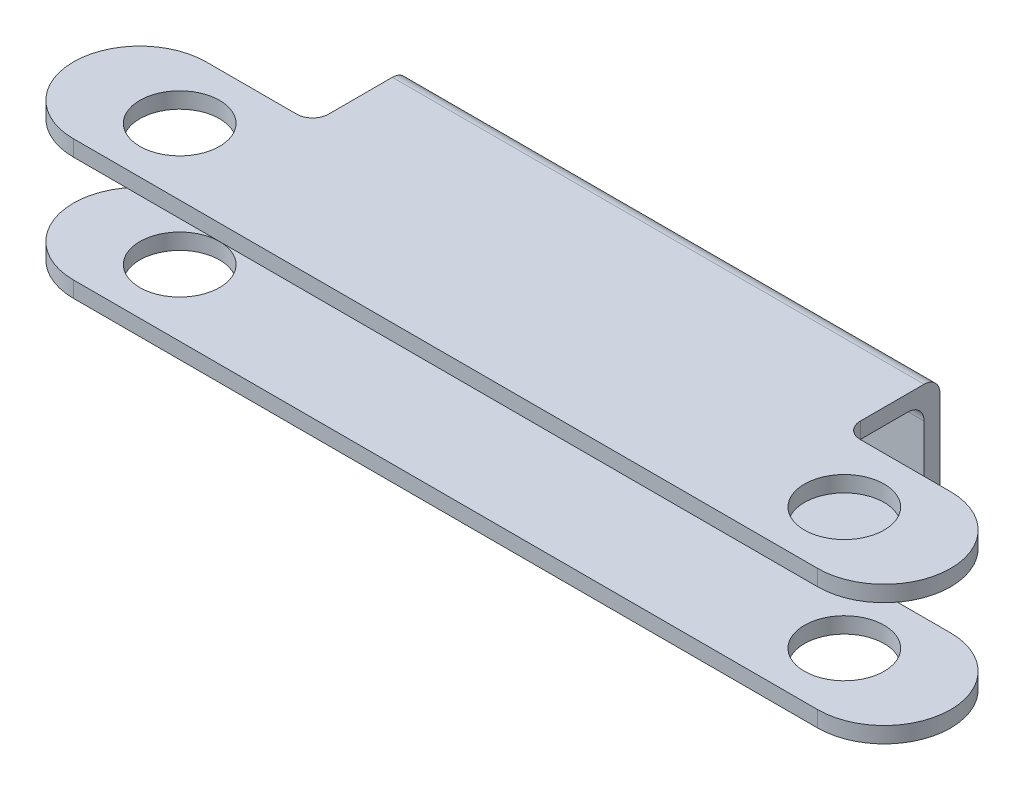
ISO-10303-21;
HEADER;
FILE_DESCRIPTION(('STEP AP214'),'2;1');
FILE_NAME('part.step','',(''),(''),'','','');
FILE_SCHEMA(('AUTOMOTIVE_DESIGN { 1 0 10303 214 1 1 1 1 }'));
ENDSEC;
DATA;
#1=APPLICATION_CONTEXT('core data for automotive mechanical design processes');
#2=APPLICATION_PROTOCOL_DEFINITION('international standard','automotive_design',2000,#1);
#3=PRODUCT_CONTEXT('',#1,'mechanical');
#4=PRODUCT('Part','Part','',(#3));
#5=PRODUCT_RELATED_PRODUCT_CATEGORY('part','',(#4));
#6=PRODUCT_DEFINITION_FORMATION('','',#4);
#7=PRODUCT_DEFINITION_CONTEXT('part definition',#1,'design');
#8=PRODUCT_DEFINITION('design','',#6,#7);
#9=PRODUCT_DEFINITION_SHAPE('','',#8);
#10=(LENGTH_UNIT() NAMED_UNIT(*) SI_UNIT(.MILLI.,.METRE.));
#11=(NAMED_UNIT(*) PLANE_ANGLE_UNIT() SI_UNIT($,.RADIAN.));
#12=(NAMED_UNIT(*) SI_UNIT($,.STERADIAN.) SOLID_ANGLE_UNIT());
#13=UNCERTAINTY_MEASURE_WITH_UNIT(LENGTH_MEASURE(1.E-05),#10,'distance_accuracy_value','');
#14=(GEOMETRIC_REPRESENTATION_CONTEXT(3) GLOBAL_UNCERTAINTY_ASSIGNED_CONTEXT((#13)) GLOBAL_UNIT_ASSIGNED_CONTEXT((#10,
#11,#12)) REPRESENTATION_CONTEXT('',''));
#15=CARTESIAN_POINT('',(0.,0.,0.));
#16=DIRECTION('',(0.,0.,1.));
#17=DIRECTION('',(1.,0.,0.));
#18=AXIS2_PLACEMENT_3D('',#15,#16,#17);
#19=CARTESIAN_POINT('',(-100.,-49.,-55.));
#20=DIRECTION('',(0.,0.,1.));
#21=DIRECTION('',(1.,0.,0.));
#22=AXIS2_PLACEMENT_3D('',#19,#20,#21);
#23=PLANE('',#22);
#24=DIRECTION('',(0.,1.,0.));
#25=VECTOR('',#24,1.);
#26=CARTESIAN_POINT('',(-100.,-49.,-55.));
#27=LINE('',#26,#25);
#28=CARTESIAN_POINT('',(-100.,-40.,-55.));
#29=VERTEX_POINT('',#28);
#30=CARTESIAN_POINT('',(-100.,-6.,-55.));
#31=VERTEX_POINT('',#30);
#32=EDGE_CURVE('E34',#29,#31,#27,.T.);
#33=ORIENTED_EDGE('',*,*,#32,.F.);
#34=DIRECTION('',(-1.,0.,0.));
#35=VECTOR('',#34,1.);
#36=CARTESIAN_POINT('',(-100.,-40.,-55.));
#37=LINE('',#36,#35);
#38=CARTESIAN_POINT('',(100.,-40.,-55.));
#39=VERTEX_POINT('',#38);
#40=EDGE_CURVE('E254',#39,#29,#37,.T.);
#41=ORIENTED_EDGE('',*,*,#40,.F.);
#42=DIRECTION('',(0.,1.,0.));
#43=VECTOR('',#42,1.);
#44=CARTESIAN_POINT('',(100.,-49.,-55.));
#45=LINE('',#44,#43);
#46=CARTESIAN_POINT('',(100.,-6.,-55.));
#47=VERTEX_POINT('',#46);
#48=EDGE_CURVE('E309',#39,#47,#45,.T.);
#49=ORIENTED_EDGE('',*,*,#48,.T.);
#50=DIRECTION('',(-1.,0.,0.));
#51=VECTOR('',#50,1.);
#52=CARTESIAN_POINT('',(-100.,-6.,-55.));
#53=LINE('',#52,#51);
#54=EDGE_CURVE('E313',#47,#31,#53,.T.);
#55=ORIENTED_EDGE('',*,*,#54,.T.);
#56=EDGE_LOOP('',(#33,#41,#49,#55));
#57=FACE_BOUND('',#56,.T.);
#58=ADVANCED_FACE('F30',(#57),#23,.T.);
#59=CARTESIAN_POINT('',(-106.,6.,-31.));
#60=DIRECTION('',(0.,1.,0.));
#61=DIRECTION('',(0.,0.,1.));
#62=AXIS2_PLACEMENT_3D('',#59,#60,#61);
#63=PLANE('',#62);
#64=CARTESIAN_POINT('',(-125.,6.,0.));
#65=DIRECTION('',(0.,1.,0.));
#66=DIRECTION('',(0.,0.,1.));
#67=AXIS2_PLACEMENT_3D('',#64,#65,#66);
#68=CIRCLE('',#67,15.);
#69=CARTESIAN_POINT('',(-125.,6.,15.));
#70=VERTEX_POINT('',#69);
#71=EDGE_CURVE('E360',#70,#70,#68,.T.);
#72=ORIENTED_EDGE('',*,*,#71,.F.);
#73=EDGE_LOOP('',(#72));
#74=FACE_BOUND('',#73,.T.);
#75=DIRECTION('',(0.,0.,-1.));
#76=VECTOR('',#75,1.);
#77=CARTESIAN_POINT('',(100.,6.,-55.));
#78=LINE('',#77,#76);
#79=CARTESIAN_POINT('',(100.,6.,-31.));
#80=VERTEX_POINT('',#79);
#81=CARTESIAN_POINT('',(100.,6.,-55.));
#82=VERTEX_POINT('',#81);
#83=EDGE_CURVE('E420',#80,#82,#78,.T.);
#84=ORIENTED_EDGE('',*,*,#83,.T.);
#85=DIRECTION('',(-1.,0.,0.));
#86=VECTOR('',#85,1.);
#87=CARTESIAN_POINT('',(-106.,6.,-55.));
#88=LINE('',#87,#86);
#89=CARTESIAN_POINT('',(-100.,6.,-55.));
#90=VERTEX_POINT('',#89);
#91=EDGE_CURVE('E329',#82,#90,#88,.T.);
#92=ORIENTED_EDGE('',*,*,#91,.T.);
#93=DIRECTION('',(0.,0.,1.));
#94=VECTOR('',#93,1.);
#95=CARTESIAN_POINT('',(-100.,6.,-31.));
#96=LINE('',#95,#94);
#97=CARTESIAN_POINT('',(-100.,6.,-31.));
#98=VERTEX_POINT('',#97);
#99=EDGE_CURVE('E368',#90,#98,#96,.T.);
#100=ORIENTED_EDGE('',*,*,#99,.T.);
#101=CARTESIAN_POINT('',(-106.,6.,-31.));
#102=DIRECTION('',(0.,-1.,0.));
#103=DIRECTION('',(0.,0.,1.));
#104=AXIS2_PLACEMENT_3D('',#101,#102,#103);
#105=CIRCLE('',#104,5.99999999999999);
#106=CARTESIAN_POINT('',(-106.,6.,-25.));
#107=VERTEX_POINT('',#106);
#108=EDGE_CURVE('E317',#98,#107,#105,.T.);
#109=ORIENTED_EDGE('',*,*,#108,.T.);
#110=DIRECTION('',(-1.,0.,0.));
#111=VECTOR('',#110,1.);
#112=CARTESIAN_POINT('',(-140.,6.,-25.));
#113=LINE('',#112,#111);
#114=CARTESIAN_POINT('',(-140.,6.,-25.));
#115=VERTEX_POINT('',#114);
#116=EDGE_CURVE('E402',#107,#115,#113,.T.);
#117=ORIENTED_EDGE('',*,*,#116,.T.);
#118=CARTESIAN_POINT('',(-140.,6.,0.));
#119=DIRECTION('',(0.,1.,0.));
#120=DIRECTION('',(0.,0.,1.));
#121=AXIS2_PLACEMENT_3D('',#118,#119,#120);
#122=CIRCLE('',#121,25.);
#123=CARTESIAN_POINT('',(-140.,6.,25.));
#124=VERTEX_POINT('',#123);
#125=EDGE_CURVE('E408',#115,#124,#122,.T.);
#126=ORIENTED_EDGE('',*,*,#125,.T.);
#127=DIRECTION('',(1.,0.,0.));
#128=VECTOR('',#127,1.);
#129=CARTESIAN_POINT('',(-140.,6.,25.));
#130=LINE('',#129,#128);
#131=CARTESIAN_POINT('',(140.,6.,25.));
#132=VERTEX_POINT('',#131);
#133=EDGE_CURVE('E413',#124,#132,#130,.T.);
#134=ORIENTED_EDGE('',*,*,#133,.T.);
#135=CARTESIAN_POINT('',(140.,6.,0.));
#136=DIRECTION('',(0.,1.,0.));
#137=DIRECTION('',(0.,0.,1.));
#138=AXIS2_PLACEMENT_3D('',#135,#136,#137);
#139=CIRCLE('',#138,25.);
#140=CARTESIAN_POINT('',(140.,6.,-24.9999999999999));
#141=VERTEX_POINT('',#140);
#142=EDGE_CURVE('E415',#132,#141,#139,.T.);
#143=ORIENTED_EDGE('',*,*,#142,.T.);
#144=DIRECTION('',(-1.,0.,0.));
#145=VECTOR('',#144,1.);
#146=CARTESIAN_POINT('',(106.,6.,-25.));
#147=LINE('',#146,#145);
#148=CARTESIAN_POINT('',(106.,6.,-25.));
#149=VERTEX_POINT('',#148);
#150=EDGE_CURVE('E417',#141,#149,#147,.T.);
#151=ORIENTED_EDGE('',*,*,#150,.T.);
#152=CARTESIAN_POINT('',(106.,6.,-31.));
#153=DIRECTION('',(0.,-1.,0.));
#154=DIRECTION('',(0.,0.,1.));
#155=AXIS2_PLACEMENT_3D('',#152,#153,#154);
#156=CIRCLE('',#155,6.00000000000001);
#157=EDGE_CURVE('E419',#149,#80,#156,.T.);
#158=ORIENTED_EDGE('',*,*,#157,.T.);
#159=EDGE_LOOP('',(#84,#92,#100,#109,#117,#126,#134,#143,#151,#158));
#160=FACE_BOUND('',#159,.T.);
#161=CARTESIAN_POINT('',(125.,6.,0.));
#162=DIRECTION('',(0.,1.,0.));
#163=DIRECTION('',(0.,0.,1.));
#164=AXIS2_PLACEMENT_3D('',#161,#162,#163);
#165=CIRCLE('',#164,15.);
#166=CARTESIAN_POINT('',(125.,6.,15.));
#167=VERTEX_POINT('',#166);
#168=EDGE_CURVE('E771',#167,#167,#165,.T.);
#169=ORIENTED_EDGE('',*,*,#168,.F.);
#170=EDGE_LOOP('',(#169));
#171=FACE_BOUND('',#170,.T.);
#172=ADVANCED_FACE('F422',(#74,#160,#171),#63,.T.);
#173=CARTESIAN_POINT('',(-106.,0.,-31.));
#174=DIRECTION('',(0.,1.,0.));
#175=DIRECTION('',(0.,0.,1.));
#176=AXIS2_PLACEMENT_3D('',#173,#174,#175);
#177=PLANE('',#176);
#178=CARTESIAN_POINT('',(-125.,0.,0.));
#179=DIRECTION('',(0.,1.,0.));
#180=DIRECTION('',(0.,0.,1.));
#181=AXIS2_PLACEMENT_3D('',#178,#179,#180);
#182=CIRCLE('',#181,15.);
#183=CARTESIAN_POINT('',(-125.,0.,15.));
#184=VERTEX_POINT('',#183);
#185=EDGE_CURVE('E365',#184,#184,#182,.T.);
#186=ORIENTED_EDGE('',*,*,#185,.T.);
#187=EDGE_LOOP('',(#186));
#188=FACE_BOUND('',#187,.T.);
#189=DIRECTION('',(0.,0.,1.));
#190=VECTOR('',#189,1.);
#191=CARTESIAN_POINT('',(-100.,0.,-31.));
#192=LINE('',#191,#190);
#193=CARTESIAN_POINT('',(-100.,0.,-49.));
#194=VERTEX_POINT('',#193);
#195=CARTESIAN_POINT('',(-100.,0.,-31.));
#196=VERTEX_POINT('',#195);
#197=EDGE_CURVE('E314',#194,#196,#192,.T.);
#198=ORIENTED_EDGE('',*,*,#197,.F.);
#199=DIRECTION('',(-1.,0.,0.));
#200=VECTOR('',#199,1.);
#201=CARTESIAN_POINT('',(-106.,0.,-49.));
#202=LINE('',#201,#200);
#203=CARTESIAN_POINT('',(100.,0.,-49.));
#204=VERTEX_POINT('',#203);
#205=EDGE_CURVE('E56',#194,#204,#202,.F.);
#206=ORIENTED_EDGE('',*,*,#205,.T.);
#207=DIRECTION('',(0.,0.,-1.));
#208=VECTOR('',#207,1.);
#209=CARTESIAN_POINT('',(100.,0.,-55.));
#210=LINE('',#209,#208);
#211=CARTESIAN_POINT('',(100.,0.,-31.));
#212=VERTEX_POINT('',#211);
#213=EDGE_CURVE('E318',#212,#204,#210,.T.);
#214=ORIENTED_EDGE('',*,*,#213,.F.);
#215=CARTESIAN_POINT('',(106.,0.,-31.));
#216=DIRECTION('',(0.,-1.,0.));
#217=DIRECTION('',(0.,0.,1.));
#218=AXIS2_PLACEMENT_3D('',#215,#216,#217);
#219=CIRCLE('',#218,6.00000000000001);
#220=CARTESIAN_POINT('',(106.,0.,-25.));
#221=VERTEX_POINT('',#220);
#222=EDGE_CURVE('E326',#221,#212,#219,.T.);
#223=ORIENTED_EDGE('',*,*,#222,.F.);
#224=DIRECTION('',(-1.,0.,0.));
#225=VECTOR('',#224,1.);
#226=CARTESIAN_POINT('',(106.,0.,-25.));
#227=LINE('',#226,#225);
#228=CARTESIAN_POINT('',(140.,0.,-24.9999999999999));
#229=VERTEX_POINT('',#228);
#230=EDGE_CURVE('E376',#229,#221,#227,.T.);
#231=ORIENTED_EDGE('',*,*,#230,.F.);
#232=CARTESIAN_POINT('',(140.,0.,0.));
#233=DIRECTION('',(0.,1.,0.));
#234=DIRECTION('',(0.,0.,1.));
#235=AXIS2_PLACEMENT_3D('',#232,#233,#234);
#236=CIRCLE('',#235,25.);
#237=CARTESIAN_POINT('',(140.,0.,25.));
#238=VERTEX_POINT('',#237);
#239=EDGE_CURVE('E374',#238,#229,#236,.T.);
#240=ORIENTED_EDGE('',*,*,#239,.F.);
#241=DIRECTION('',(1.,0.,0.));
#242=VECTOR('',#241,1.);
#243=CARTESIAN_POINT('',(-140.,0.,25.));
#244=LINE('',#243,#242);
#245=CARTESIAN_POINT('',(-140.,0.,25.));
#246=VERTEX_POINT('',#245);
#247=EDGE_CURVE('E372',#246,#238,#244,.T.);
#248=ORIENTED_EDGE('',*,*,#247,.F.);
#249=CARTESIAN_POINT('',(-140.,0.,0.));
#250=DIRECTION('',(0.,1.,0.));
#251=DIRECTION('',(0.,0.,1.));
#252=AXIS2_PLACEMENT_3D('',#249,#250,#251);
#253=CIRCLE('',#252,25.);
#254=CARTESIAN_POINT('',(-140.,0.,-25.));
#255=VERTEX_POINT('',#254);
#256=EDGE_CURVE('E362',#255,#246,#253,.T.);
#257=ORIENTED_EDGE('',*,*,#256,.F.);
#258=DIRECTION('',(-1.,0.,0.));
#259=VECTOR('',#258,1.);
#260=CARTESIAN_POINT('',(-140.,0.,-25.));
#261=LINE('',#260,#259);
#262=CARTESIAN_POINT('',(-106.,0.,-25.));
#263=VERTEX_POINT('',#262);
#264=EDGE_CURVE('E356',#263,#255,#261,.T.);
#265=ORIENTED_EDGE('',*,*,#264,.F.);
#266=CARTESIAN_POINT('',(-106.,0.,-31.));
#267=DIRECTION('',(0.,-1.,0.));
#268=DIRECTION('',(0.,0.,1.));
#269=AXIS2_PLACEMENT_3D('',#266,#267,#268);
#270=CIRCLE('',#269,5.99999999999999);
#271=EDGE_CURVE('E354',#196,#263,#270,.T.);
#272=ORIENTED_EDGE('',*,*,#271,.F.);
#273=EDGE_LOOP('',(#198,#206,#214,#223,#231,#240,#248,#257,#265,#272));
#274=FACE_BOUND('',#273,.T.);
#275=CARTESIAN_POINT('',(125.,0.,0.));
#276=DIRECTION('',(0.,1.,0.));
#277=DIRECTION('',(0.,0.,1.));
#278=AXIS2_PLACEMENT_3D('',#275,#276,#277);
#279=CIRCLE('',#278,15.);
#280=CARTESIAN_POINT('',(125.,0.,15.));
#281=VERTEX_POINT('',#280);
#282=EDGE_CURVE('E298',#281,#281,#279,.T.);
#283=ORIENTED_EDGE('',*,*,#282,.T.);
#284=EDGE_LOOP('',(#283));
#285=FACE_BOUND('',#284,.T.);
#286=ADVANCED_FACE('F351',(#188,#274,#285),#177,.F.);
#287=CARTESIAN_POINT('',(-106.,6.,-31.));
#288=DIRECTION('',(0.,-1.,0.));
#289=DIRECTION('',(0.,0.,-1.));
#290=AXIS2_PLACEMENT_3D('',#287,#288,#289);
#291=CYLINDRICAL_SURFACE('',#290,5.99999999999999);
#292=ORIENTED_EDGE('',*,*,#271,.T.);
#293=DIRECTION('',(0.,-1.,0.));
#294=VECTOR('',#293,1.);
#295=CARTESIAN_POINT('',(-106.,6.,-25.));
#296=LINE('',#295,#294);
#297=EDGE_CURVE('E323',#107,#263,#296,.T.);
#298=ORIENTED_EDGE('',*,*,#297,.F.);
#299=ORIENTED_EDGE('',*,*,#108,.F.);
#300=DIRECTION('',(0.,-1.,0.));
#301=VECTOR('',#300,1.);
#302=CARTESIAN_POINT('',(-100.,6.,-31.));
#303=LINE('',#302,#301);
#304=EDGE_CURVE('E379',#98,#196,#303,.T.);
#305=ORIENTED_EDGE('',*,*,#304,.T.);
#306=EDGE_LOOP('',(#292,#298,#299,#305));
#307=FACE_BOUND('',#306,.T.);
#308=ADVANCED_FACE('F405',(#307),#291,.F.);
#309=CARTESIAN_POINT('',(-140.,6.,-25.));
#310=DIRECTION('',(0.,0.,1.));
#311=DIRECTION('',(1.,0.,0.));
#312=AXIS2_PLACEMENT_3D('',#309,#310,#311);
#313=PLANE('',#312);
#314=ORIENTED_EDGE('',*,*,#264,.T.);
#315=DIRECTION('',(0.,-1.,0.));
#316=VECTOR('',#315,1.);
#317=CARTESIAN_POINT('',(-140.,6.,-25.));
#318=LINE('',#317,#316);
#319=EDGE_CURVE('E395',#115,#255,#318,.T.);
#320=ORIENTED_EDGE('',*,*,#319,.F.);
#321=ORIENTED_EDGE('',*,*,#116,.F.);
#322=ORIENTED_EDGE('',*,*,#297,.T.);
#323=EDGE_LOOP('',(#314,#320,#321,#322));
#324=FACE_BOUND('',#323,.T.);
#325=ADVANCED_FACE('F401',(#324),#313,.F.);
#326=CARTESIAN_POINT('',(-140.,6.,0.));
#327=DIRECTION('',(0.,-1.,0.));
#328=DIRECTION('',(0.,0.,-1.));
#329=AXIS2_PLACEMENT_3D('',#326,#327,#328);
#330=CYLINDRICAL_SURFACE('',#329,25.);
#331=ORIENTED_EDGE('',*,*,#256,.T.);
#332=DIRECTION('',(0.,-1.,0.));
#333=VECTOR('',#332,1.);
#334=CARTESIAN_POINT('',(-140.,6.,25.));
#335=LINE('',#334,#333);
#336=EDGE_CURVE('E393',#124,#246,#335,.T.);
#337=ORIENTED_EDGE('',*,*,#336,.F.);
#338=ORIENTED_EDGE('',*,*,#125,.F.);
#339=ORIENTED_EDGE('',*,*,#319,.T.);
#340=EDGE_LOOP('',(#331,#337,#338,#339));
#341=FACE_BOUND('',#340,.T.);
#342=ADVANCED_FACE('F505',(#341),#330,.T.);
#343=CARTESIAN_POINT('',(-140.,6.,25.));
#344=DIRECTION('',(0.,0.,-1.));
#345=DIRECTION('',(-1.,0.,0.));
#346=AXIS2_PLACEMENT_3D('',#343,#344,#345);
#347=PLANE('',#346);
#348=ORIENTED_EDGE('',*,*,#247,.T.);
#349=DIRECTION('',(0.,-1.,0.));
#350=VECTOR('',#349,1.);
#351=CARTESIAN_POINT('',(140.,6.,25.));
#352=LINE('',#351,#350);
#353=EDGE_CURVE('E390',#132,#238,#352,.T.);
#354=ORIENTED_EDGE('',*,*,#353,.F.);
#355=ORIENTED_EDGE('',*,*,#133,.F.);
#356=ORIENTED_EDGE('',*,*,#336,.T.);
#357=EDGE_LOOP('',(#348,#354,#355,#356));
#358=FACE_BOUND('',#357,.T.);
#359=ADVANCED_FACE('F502',(#358),#347,.F.);
#360=CARTESIAN_POINT('',(140.,6.,0.));
#361=DIRECTION('',(0.,-1.,0.));
#362=DIRECTION('',(0.,0.,-1.));
#363=AXIS2_PLACEMENT_3D('',#360,#361,#362);
#364=CYLINDRICAL_SURFACE('',#363,25.);
#365=ORIENTED_EDGE('',*,*,#239,.T.);
#366=DIRECTION('',(0.,-1.,0.));
#367=VECTOR('',#366,1.);
#368=CARTESIAN_POINT('',(140.,6.,-24.9999999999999));
#369=LINE('',#368,#367);
#370=EDGE_CURVE('E387',#141,#229,#369,.T.);
#371=ORIENTED_EDGE('',*,*,#370,.F.);
#372=ORIENTED_EDGE('',*,*,#142,.F.);
#373=ORIENTED_EDGE('',*,*,#353,.T.);
#374=EDGE_LOOP('',(#365,#371,#372,#373));
#375=FACE_BOUND('',#374,.T.);
#376=ADVANCED_FACE('F498',(#375),#364,.T.);
#377=CARTESIAN_POINT('',(106.,6.,-25.));
#378=DIRECTION('',(0.,0.,1.));
#379=DIRECTION('',(1.,0.,0.));
#380=AXIS2_PLACEMENT_3D('',#377,#378,#379);
#381=PLANE('',#380);
#382=ORIENTED_EDGE('',*,*,#230,.T.);
#383=DIRECTION('',(0.,-1.,0.));
#384=VECTOR('',#383,1.);
#385=CARTESIAN_POINT('',(106.,6.,-25.));
#386=LINE('',#385,#384);
#387=EDGE_CURVE('E384',#149,#221,#386,.T.);
#388=ORIENTED_EDGE('',*,*,#387,.F.);
#389=ORIENTED_EDGE('',*,*,#150,.F.);
#390=ORIENTED_EDGE('',*,*,#370,.T.);
#391=EDGE_LOOP('',(#382,#388,#389,#390));
#392=FACE_BOUND('',#391,.T.);
#393=ADVANCED_FACE('F494',(#392),#381,.F.);
#394=CARTESIAN_POINT('',(106.,6.,-31.));
#395=DIRECTION('',(0.,-1.,0.));
#396=DIRECTION('',(0.,0.,-1.));
#397=AXIS2_PLACEMENT_3D('',#394,#395,#396);
#398=CYLINDRICAL_SURFACE('',#397,6.00000000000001);
#399=ORIENTED_EDGE('',*,*,#222,.T.);
#400=DIRECTION('',(0.,-1.,0.));
#401=VECTOR('',#400,1.);
#402=CARTESIAN_POINT('',(100.,6.,-31.));
#403=LINE('',#402,#401);
#404=EDGE_CURVE('E381',#80,#212,#403,.T.);
#405=ORIENTED_EDGE('',*,*,#404,.F.);
#406=ORIENTED_EDGE('',*,*,#157,.F.);
#407=ORIENTED_EDGE('',*,*,#387,.T.);
#408=EDGE_LOOP('',(#399,#405,#406,#407));
#409=FACE_BOUND('',#408,.T.);
#410=ADVANCED_FACE('F489',(#409),#398,.F.);
#411=CARTESIAN_POINT('',(100.,6.,-55.));
#412=DIRECTION('',(-1.,0.,0.));
#413=DIRECTION('',(0.,0.,1.));
#414=AXIS2_PLACEMENT_3D('',#411,#412,#413);
#415=PLANE('',#414);
#416=DIRECTION('',(0.,1.,0.));
#417=VECTOR('',#416,1.);
#418=CARTESIAN_POINT('',(100.,-49.,-61.));
#419=LINE('',#418,#417);
#420=CARTESIAN_POINT('',(100.,-49.,-61.));
#421=VERTEX_POINT('',#420);
#422=CARTESIAN_POINT('',(100.,0.,-61.));
#423=VERTEX_POINT('',#422);
#424=EDGE_CURVE('E299',#421,#423,#419,.T.);
#425=ORIENTED_EDGE('',*,*,#424,.T.);
#426=CARTESIAN_POINT('',(100.,0.,-55.));
#427=DIRECTION('',(-1.,0.,0.));
#428=DIRECTION('',(0.,0.,1.));
#429=AXIS2_PLACEMENT_3D('',#426,#427,#428);
#430=CIRCLE('',#429,6.);
#431=EDGE_CURVE('E335',#423,#82,#430,.F.);
#432=ORIENTED_EDGE('',*,*,#431,.T.);
#433=ORIENTED_EDGE('',*,*,#83,.F.);
#434=ORIENTED_EDGE('',*,*,#404,.T.);
#435=ORIENTED_EDGE('',*,*,#213,.T.);
#436=CARTESIAN_POINT('',(100.,-6.,-49.));
#437=DIRECTION('',(-1.,0.,0.));
#438=DIRECTION('',(0.,0.,1.));
#439=AXIS2_PLACEMENT_3D('',#436,#437,#438);
#440=CIRCLE('',#439,6.);
#441=EDGE_CURVE('E11',#204,#47,#440,.T.);
#442=ORIENTED_EDGE('',*,*,#441,.T.);
#443=ORIENTED_EDGE('',*,*,#48,.F.);
#444=DIRECTION('',(0.,0.,-1.));
#445=VECTOR('',#444,1.);
#446=CARTESIAN_POINT('',(100.,-40.,-55.));
#447=LINE('',#446,#445);
#448=CARTESIAN_POINT('',(100.,-40.,-31.));
#449=VERTEX_POINT('',#448);
#450=EDGE_CURVE('E48',#449,#39,#447,.T.);
#451=ORIENTED_EDGE('',*,*,#450,.F.);
#452=DIRECTION('',(0.,1.,0.));
#453=VECTOR('',#452,1.);
#454=CARTESIAN_POINT('',(100.,-46.,-31.));
#455=LINE('',#454,#453);
#456=CARTESIAN_POINT('',(100.,-46.,-31.));
#457=VERTEX_POINT('',#456);
#458=EDGE_CURVE('E209',#457,#449,#455,.T.);
#459=ORIENTED_EDGE('',*,*,#458,.F.);
#460=DIRECTION('',(0.,0.,-1.));
#461=VECTOR('',#460,1.);
#462=CARTESIAN_POINT('',(100.,-46.,-55.));
#463=LINE('',#462,#461);
#464=CARTESIAN_POINT('',(100.,-46.,-55.));
#465=VERTEX_POINT('',#464);
#466=EDGE_CURVE('E227',#457,#465,#463,.T.);
#467=ORIENTED_EDGE('',*,*,#466,.T.);
#468=CARTESIAN_POINT('',(100.,-49.,-55.));
#469=VERTEX_POINT('',#468);
#470=EDGE_CURVE('E302',#469,#465,#45,.T.);
#471=ORIENTED_EDGE('',*,*,#470,.F.);
#472=DIRECTION('',(0.,0.,-1.));
#473=VECTOR('',#472,1.);
#474=CARTESIAN_POINT('',(100.,-49.,-55.));
#475=LINE('',#474,#473);
#476=EDGE_CURVE('E289',#469,#421,#475,.T.);
#477=ORIENTED_EDGE('',*,*,#476,.T.);
#478=EDGE_LOOP('',(#425,#432,#433,#434,#435,#442,#443,#451,#459,#467,#471,#477));
#479=FACE_BOUND('',#478,.T.);
#480=ADVANCED_FACE('F460',(#479),#415,.F.);
#481=CARTESIAN_POINT('',(-100.,6.,-31.));
#482=DIRECTION('',(1.,0.,0.));
#483=DIRECTION('',(0.,0.,-1.));
#484=AXIS2_PLACEMENT_3D('',#481,#482,#483);
#485=PLANE('',#484);
#486=ORIENTED_EDGE('',*,*,#99,.F.);
#487=CARTESIAN_POINT('',(-100.,0.,-55.));
#488=DIRECTION('',(1.,0.,0.));
#489=DIRECTION('',(0.,0.,-1.));
#490=AXIS2_PLACEMENT_3D('',#487,#488,#489);
#491=CIRCLE('',#490,6.);
#492=CARTESIAN_POINT('',(-100.,0.,-61.));
#493=VERTEX_POINT('',#492);
#494=EDGE_CURVE('E332',#90,#493,#491,.F.);
#495=ORIENTED_EDGE('',*,*,#494,.T.);
#496=DIRECTION('',(0.,1.,0.));
#497=VECTOR('',#496,1.);
#498=CARTESIAN_POINT('',(-100.,-49.,-61.));
#499=LINE('',#498,#497);
#500=CARTESIAN_POINT('',(-100.,-49.,-61.));
#501=VERTEX_POINT('',#500);
#502=EDGE_CURVE('E295',#501,#493,#499,.T.);
#503=ORIENTED_EDGE('',*,*,#502,.F.);
#504=DIRECTION('',(0.,0.,1.));
#505=VECTOR('',#504,1.);
#506=CARTESIAN_POINT('',(-100.,-49.,-55.));
#507=LINE('',#506,#505);
#508=CARTESIAN_POINT('',(-100.,-49.,-55.));
#509=VERTEX_POINT('',#508);
#510=EDGE_CURVE('E208',#501,#509,#507,.T.);
#511=ORIENTED_EDGE('',*,*,#510,.T.);
#512=CARTESIAN_POINT('',(-100.,-46.,-55.));
#513=VERTEX_POINT('',#512);
#514=EDGE_CURVE('E224',#509,#513,#27,.T.);
#515=ORIENTED_EDGE('',*,*,#514,.T.);
#516=DIRECTION('',(0.,0.,1.));
#517=VECTOR('',#516,1.);
#518=CARTESIAN_POINT('',(-100.,-46.,-31.));
#519=LINE('',#518,#517);
#520=CARTESIAN_POINT('',(-100.,-46.,-31.));
#521=VERTEX_POINT('',#520);
#522=EDGE_CURVE('E213',#513,#521,#519,.T.);
#523=ORIENTED_EDGE('',*,*,#522,.T.);
#524=DIRECTION('',(0.,1.,0.));
#525=VECTOR('',#524,1.);
#526=CARTESIAN_POINT('',(-100.,-46.,-31.));
#527=LINE('',#526,#525);
#528=CARTESIAN_POINT('',(-100.,-40.,-31.));
#529=VERTEX_POINT('',#528);
#530=EDGE_CURVE('E198',#521,#529,#527,.T.);
#531=ORIENTED_EDGE('',*,*,#530,.T.);
#532=DIRECTION('',(0.,0.,1.));
#533=VECTOR('',#532,1.);
#534=CARTESIAN_POINT('',(-100.,-40.,-31.));
#535=LINE('',#534,#533);
#536=EDGE_CURVE('E251',#29,#529,#535,.T.);
#537=ORIENTED_EDGE('',*,*,#536,.F.);
#538=ORIENTED_EDGE('',*,*,#32,.T.);
#539=CARTESIAN_POINT('',(-100.,-6.,-49.));
#540=DIRECTION('',(1.,0.,0.));
#541=DIRECTION('',(0.,0.,-1.));
#542=AXIS2_PLACEMENT_3D('',#539,#540,#541);
#543=CIRCLE('',#542,6.);
#544=EDGE_CURVE('E40',#31,#194,#543,.T.);
#545=ORIENTED_EDGE('',*,*,#544,.T.);
#546=ORIENTED_EDGE('',*,*,#197,.T.);
#547=ORIENTED_EDGE('',*,*,#304,.F.);
#548=EDGE_LOOP('',(#486,#495,#503,#511,#515,#523,#531,#537,#538,#545,#546,#547));
#549=FACE_BOUND('',#548,.T.);
#550=ADVANCED_FACE('F222',(#549),#485,.F.);
#551=CARTESIAN_POINT('',(-125.,6.,0.));
#552=DIRECTION('',(0.,-1.,0.));
#553=DIRECTION('',(0.,0.,-1.));
#554=AXIS2_PLACEMENT_3D('',#551,#552,#553);
#555=CYLINDRICAL_SURFACE('',#554,15.);
#556=ORIENTED_EDGE('',*,*,#71,.T.);
#557=EDGE_LOOP('',(#556));
#558=FACE_BOUND('',#557,.T.);
#559=ORIENTED_EDGE('',*,*,#185,.F.);
#560=EDGE_LOOP('',(#559));
#561=FACE_BOUND('',#560,.T.);
#562=ADVANCED_FACE('F528',(#558,#561),#555,.F.);
#563=CARTESIAN_POINT('',(125.,6.,0.));
#564=DIRECTION('',(0.,-1.,0.));
#565=DIRECTION('',(0.,0.,-1.));
#566=AXIS2_PLACEMENT_3D('',#563,#564,#565);
#567=CYLINDRICAL_SURFACE('',#566,15.);
#568=ORIENTED_EDGE('',*,*,#168,.T.);
#569=EDGE_LOOP('',(#568));
#570=FACE_BOUND('',#569,.T.);
#571=ORIENTED_EDGE('',*,*,#282,.F.);
#572=EDGE_LOOP('',(#571));
#573=FACE_BOUND('',#572,.T.);
#574=ADVANCED_FACE('F455',(#570,#573),#567,.F.);
#575=CARTESIAN_POINT('',(-100.,-49.,-61.));
#576=DIRECTION('',(0.,0.,-1.));
#577=DIRECTION('',(-1.,0.,0.));
#578=AXIS2_PLACEMENT_3D('',#575,#576,#577);
#579=PLANE('',#578);
#580=ORIENTED_EDGE('',*,*,#502,.T.);
#581=DIRECTION('',(-1.,0.,0.));
#582=VECTOR('',#581,1.);
#583=CARTESIAN_POINT('',(-100.,0.,-61.));
#584=LINE('',#583,#582);
#585=EDGE_CURVE('E334',#493,#423,#584,.F.);
#586=ORIENTED_EDGE('',*,*,#585,.T.);
#587=ORIENTED_EDGE('',*,*,#424,.F.);
#588=DIRECTION('',(-1.,0.,0.));
#589=VECTOR('',#588,1.);
#590=CARTESIAN_POINT('',(-100.,-49.,-61.));
#591=LINE('',#590,#589);
#592=EDGE_CURVE('E292',#421,#501,#591,.T.);
#593=ORIENTED_EDGE('',*,*,#592,.T.);
#594=EDGE_LOOP('',(#580,#586,#587,#593));
#595=FACE_BOUND('',#594,.T.);
#596=ADVANCED_FACE('F428',(#595),#579,.T.);
#597=DIRECTION('',(-1.,0.,0.));
#598=VECTOR('',#597,1.);
#599=CARTESIAN_POINT('',(-100.,-46.,-55.));
#600=LINE('',#599,#598);
#601=EDGE_CURVE('E225',#465,#513,#600,.T.);
#602=ORIENTED_EDGE('',*,*,#601,.T.);
#603=ORIENTED_EDGE('',*,*,#514,.F.);
#604=DIRECTION('',(1.,0.,0.));
#605=VECTOR('',#604,1.);
#606=CARTESIAN_POINT('',(-100.,-49.,-55.));
#607=LINE('',#606,#605);
#608=EDGE_CURVE('E286',#509,#469,#607,.T.);
#609=ORIENTED_EDGE('',*,*,#608,.T.);
#610=ORIENTED_EDGE('',*,*,#470,.T.);
#611=EDGE_LOOP('',(#602,#603,#609,#610));
#612=FACE_BOUND('',#611,.T.);
#613=ADVANCED_FACE('F437',(#612),#23,.T.);
#614=CARTESIAN_POINT('',(-100.,-49.,-61.));
#615=DIRECTION('',(0.,-1.,0.));
#616=DIRECTION('',(0.,0.,-1.));
#617=AXIS2_PLACEMENT_3D('',#614,#615,#616);
#618=PLANE('',#617);
#619=ORIENTED_EDGE('',*,*,#510,.F.);
#620=ORIENTED_EDGE('',*,*,#592,.F.);
#621=ORIENTED_EDGE('',*,*,#476,.F.);
#622=ORIENTED_EDGE('',*,*,#608,.F.);
#623=EDGE_LOOP('',(#619,#620,#621,#622));
#624=FACE_BOUND('',#623,.T.);
#625=ADVANCED_FACE('F432',(#624),#618,.T.);
#626=CARTESIAN_POINT('',(-106.,0.,-55.));
#627=DIRECTION('',(-1.,0.,0.));
#628=DIRECTION('',(0.,0.,1.));
#629=AXIS2_PLACEMENT_3D('',#626,#627,#628);
#630=CYLINDRICAL_SURFACE('',#629,6.);
#631=ORIENTED_EDGE('',*,*,#431,.F.);
#632=ORIENTED_EDGE('',*,*,#585,.F.);
#633=ORIENTED_EDGE('',*,*,#494,.F.);
#634=ORIENTED_EDGE('',*,*,#91,.F.);
#635=EDGE_LOOP('',(#631,#632,#633,#634));
#636=FACE_BOUND('',#635,.T.);
#637=ADVANCED_FACE('F430',(#636),#630,.T.);
#638=CARTESIAN_POINT('',(-100.,-6.,-49.));
#639=DIRECTION('',(-1.,0.,0.));
#640=DIRECTION('',(0.,0.,1.));
#641=AXIS2_PLACEMENT_3D('',#638,#639,#640);
#642=CYLINDRICAL_SURFACE('',#641,6.);
#643=ORIENTED_EDGE('',*,*,#441,.F.);
#644=ORIENTED_EDGE('',*,*,#205,.F.);
#645=ORIENTED_EDGE('',*,*,#544,.F.);
#646=ORIENTED_EDGE('',*,*,#54,.F.);
#647=EDGE_LOOP('',(#643,#644,#645,#646));
#648=FACE_BOUND('',#647,.T.);
#649=ADVANCED_FACE('F32',(#648),#642,.F.);
#650=CARTESIAN_POINT('',(-106.,-46.,-31.));
#651=DIRECTION('',(0.,1.,0.));
#652=DIRECTION('',(0.,0.,1.));
#653=AXIS2_PLACEMENT_3D('',#650,#651,#652);
#654=CYLINDRICAL_SURFACE('',#653,5.99999999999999);
#655=CARTESIAN_POINT('',(-106.,-40.,-31.));
#656=DIRECTION('',(0.,-1.,0.));
#657=DIRECTION('',(0.,0.,1.));
#658=AXIS2_PLACEMENT_3D('',#655,#656,#657);
#659=CIRCLE('',#658,5.99999999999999);
#660=CARTESIAN_POINT('',(-106.,-40.,-25.));
#661=VERTEX_POINT('',#660);
#662=EDGE_CURVE('E204',#529,#661,#659,.T.);
#663=ORIENTED_EDGE('',*,*,#662,.F.);
#664=ORIENTED_EDGE('',*,*,#530,.F.);
#665=CARTESIAN_POINT('',(-106.,-46.,-31.));
#666=DIRECTION('',(0.,-1.,0.));
#667=DIRECTION('',(0.,0.,1.));
#668=AXIS2_PLACEMENT_3D('',#665,#666,#667);
#669=CIRCLE('',#668,5.99999999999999);
#670=CARTESIAN_POINT('',(-106.,-46.,-25.));
#671=VERTEX_POINT('',#670);
#672=EDGE_CURVE('E201',#521,#671,#669,.T.);
#673=ORIENTED_EDGE('',*,*,#672,.T.);
#674=DIRECTION('',(0.,1.,0.));
#675=VECTOR('',#674,1.);
#676=CARTESIAN_POINT('',(-106.,-46.,-25.));
#677=LINE('',#676,#675);
#678=EDGE_CURVE('E249',#671,#661,#677,.T.);
#679=ORIENTED_EDGE('',*,*,#678,.T.);
#680=EDGE_LOOP('',(#663,#664,#673,#679));
#681=FACE_BOUND('',#680,.T.);
#682=ADVANCED_FACE('F200',(#681),#654,.F.);
#683=CARTESIAN_POINT('',(106.,-46.,-31.));
#684=DIRECTION('',(0.,1.,0.));
#685=DIRECTION('',(0.,0.,1.));
#686=AXIS2_PLACEMENT_3D('',#683,#684,#685);
#687=CYLINDRICAL_SURFACE('',#686,6.00000000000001);
#688=CARTESIAN_POINT('',(106.,-40.,-31.));
#689=DIRECTION('',(0.,-1.,0.));
#690=DIRECTION('',(0.,0.,1.));
#691=AXIS2_PLACEMENT_3D('',#688,#689,#690);
#692=CIRCLE('',#691,6.00000000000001);
#693=CARTESIAN_POINT('',(106.,-40.,-25.));
#694=VERTEX_POINT('',#693);
#695=EDGE_CURVE('E257',#694,#449,#692,.T.);
#696=ORIENTED_EDGE('',*,*,#695,.F.);
#697=DIRECTION('',(0.,1.,0.));
#698=VECTOR('',#697,1.);
#699=CARTESIAN_POINT('',(106.,-46.,-25.));
#700=LINE('',#699,#698);
#701=CARTESIAN_POINT('',(106.,-46.,-25.));
#702=VERTEX_POINT('',#701);
#703=EDGE_CURVE('E282',#702,#694,#700,.T.);
#704=ORIENTED_EDGE('',*,*,#703,.F.);
#705=CARTESIAN_POINT('',(106.,-46.,-31.));
#706=DIRECTION('',(0.,-1.,0.));
#707=DIRECTION('',(0.,0.,1.));
#708=AXIS2_PLACEMENT_3D('',#705,#706,#707);
#709=CIRCLE('',#708,6.00000000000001);
#710=EDGE_CURVE('E233',#702,#457,#709,.T.);
#711=ORIENTED_EDGE('',*,*,#710,.T.);
#712=ORIENTED_EDGE('',*,*,#458,.T.);
#713=EDGE_LOOP('',(#696,#704,#711,#712));
#714=FACE_BOUND('',#713,.T.);
#715=ADVANCED_FACE('F464',(#714),#687,.F.);
#716=CARTESIAN_POINT('',(106.,-46.,-25.));
#717=DIRECTION('',(0.,0.,-1.));
#718=DIRECTION('',(-1.,0.,0.));
#719=AXIS2_PLACEMENT_3D('',#716,#717,#718);
#720=PLANE('',#719);
#721=DIRECTION('',(-1.,0.,0.));
#722=VECTOR('',#721,1.);
#723=CARTESIAN_POINT('',(106.,-40.,-25.));
#724=LINE('',#723,#722);
#725=CARTESIAN_POINT('',(140.,-40.,-24.9999999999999));
#726=VERTEX_POINT('',#725);
#727=EDGE_CURVE('E259',#726,#694,#724,.T.);
#728=ORIENTED_EDGE('',*,*,#727,.F.);
#729=DIRECTION('',(0.,1.,0.));
#730=VECTOR('',#729,1.);
#731=CARTESIAN_POINT('',(140.,-46.,-24.9999999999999));
#732=LINE('',#731,#730);
#733=CARTESIAN_POINT('',(140.,-46.,-24.9999999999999));
#734=VERTEX_POINT('',#733);
#735=EDGE_CURVE('E280',#734,#726,#732,.T.);
#736=ORIENTED_EDGE('',*,*,#735,.F.);
#737=DIRECTION('',(-1.,0.,0.));
#738=VECTOR('',#737,1.);
#739=CARTESIAN_POINT('',(106.,-46.,-25.));
#740=LINE('',#739,#738);
#741=EDGE_CURVE('E236',#734,#702,#740,.T.);
#742=ORIENTED_EDGE('',*,*,#741,.T.);
#743=ORIENTED_EDGE('',*,*,#703,.T.);
#744=EDGE_LOOP('',(#728,#736,#742,#743));
#745=FACE_BOUND('',#744,.T.);
#746=ADVANCED_FACE('F469',(#745),#720,.T.);
#747=CARTESIAN_POINT('',(140.,-46.,0.));
#748=DIRECTION('',(0.,1.,0.));
#749=DIRECTION('',(0.,0.,1.));
#750=AXIS2_PLACEMENT_3D('',#747,#748,#749);
#751=CYLINDRICAL_SURFACE('',#750,25.);
#752=CARTESIAN_POINT('',(140.,-40.,0.));
#753=DIRECTION('',(0.,1.,0.));
#754=DIRECTION('',(0.,0.,1.));
#755=AXIS2_PLACEMENT_3D('',#752,#753,#754);
#756=CIRCLE('',#755,25.);
#757=CARTESIAN_POINT('',(140.,-40.,25.));
#758=VERTEX_POINT('',#757);
#759=EDGE_CURVE('E262',#758,#726,#756,.T.);
#760=ORIENTED_EDGE('',*,*,#759,.F.);
#761=DIRECTION('',(0.,1.,0.));
#762=VECTOR('',#761,1.);
#763=CARTESIAN_POINT('',(140.,-46.,25.));
#764=LINE('',#763,#762);
#765=CARTESIAN_POINT('',(140.,-46.,25.));
#766=VERTEX_POINT('',#765);
#767=EDGE_CURVE('E278',#766,#758,#764,.T.);
#768=ORIENTED_EDGE('',*,*,#767,.F.);
#769=CARTESIAN_POINT('',(140.,-46.,0.));
#770=DIRECTION('',(0.,1.,0.));
#771=DIRECTION('',(0.,0.,1.));
#772=AXIS2_PLACEMENT_3D('',#769,#770,#771);
#773=CIRCLE('',#772,25.);
#774=EDGE_CURVE('E239',#766,#734,#773,.T.);
#775=ORIENTED_EDGE('',*,*,#774,.T.);
#776=ORIENTED_EDGE('',*,*,#735,.T.);
#777=EDGE_LOOP('',(#760,#768,#775,#776));
#778=FACE_BOUND('',#777,.T.);
#779=ADVANCED_FACE('F472',(#778),#751,.T.);
#780=CARTESIAN_POINT('',(-140.,-46.,25.));
#781=DIRECTION('',(0.,0.,1.));
#782=DIRECTION('',(1.,0.,0.));
#783=AXIS2_PLACEMENT_3D('',#780,#781,#782);
#784=PLANE('',#783);
#785=DIRECTION('',(1.,0.,0.));
#786=VECTOR('',#785,1.);
#787=CARTESIAN_POINT('',(-140.,-40.,25.));
#788=LINE('',#787,#786);
#789=CARTESIAN_POINT('',(-140.,-40.,25.));
#790=VERTEX_POINT('',#789);
#791=EDGE_CURVE('E265',#790,#758,#788,.T.);
#792=ORIENTED_EDGE('',*,*,#791,.F.);
#793=DIRECTION('',(0.,1.,0.));
#794=VECTOR('',#793,1.);
#795=CARTESIAN_POINT('',(-140.,-46.,25.));
#796=LINE('',#795,#794);
#797=CARTESIAN_POINT('',(-140.,-46.,25.));
#798=VERTEX_POINT('',#797);
#799=EDGE_CURVE('E276',#798,#790,#796,.T.);
#800=ORIENTED_EDGE('',*,*,#799,.F.);
#801=DIRECTION('',(1.,0.,0.));
#802=VECTOR('',#801,1.);
#803=CARTESIAN_POINT('',(-140.,-46.,25.));
#804=LINE('',#803,#802);
#805=EDGE_CURVE('E242',#798,#766,#804,.T.);
#806=ORIENTED_EDGE('',*,*,#805,.T.);
#807=ORIENTED_EDGE('',*,*,#767,.T.);
#808=EDGE_LOOP('',(#792,#800,#806,#807));
#809=FACE_BOUND('',#808,.T.);
#810=ADVANCED_FACE('F476',(#809),#784,.T.);
#811=CARTESIAN_POINT('',(-140.,-46.,0.));
#812=DIRECTION('',(0.,1.,0.));
#813=DIRECTION('',(0.,0.,1.));
#814=AXIS2_PLACEMENT_3D('',#811,#812,#813);
#815=CYLINDRICAL_SURFACE('',#814,25.);
#816=CARTESIAN_POINT('',(-140.,-40.,0.));
#817=DIRECTION('',(0.,1.,0.));
#818=DIRECTION('',(0.,0.,1.));
#819=AXIS2_PLACEMENT_3D('',#816,#817,#818);
#820=CIRCLE('',#819,25.);
#821=CARTESIAN_POINT('',(-140.,-40.,-25.));
#822=VERTEX_POINT('',#821);
#823=EDGE_CURVE('E268',#822,#790,#820,.T.);
#824=ORIENTED_EDGE('',*,*,#823,.F.);
#825=DIRECTION('',(0.,1.,0.));
#826=VECTOR('',#825,1.);
#827=CARTESIAN_POINT('',(-140.,-46.,-25.));
#828=LINE('',#827,#826);
#829=CARTESIAN_POINT('',(-140.,-46.,-25.));
#830=VERTEX_POINT('',#829);
#831=EDGE_CURVE('E274',#830,#822,#828,.T.);
#832=ORIENTED_EDGE('',*,*,#831,.F.);
#833=CARTESIAN_POINT('',(-140.,-46.,0.));
#834=DIRECTION('',(0.,1.,0.));
#835=DIRECTION('',(0.,0.,1.));
#836=AXIS2_PLACEMENT_3D('',#833,#834,#835);
#837=CIRCLE('',#836,25.);
#838=EDGE_CURVE('E245',#830,#798,#837,.T.);
#839=ORIENTED_EDGE('',*,*,#838,.T.);
#840=ORIENTED_EDGE('',*,*,#799,.T.);
#841=EDGE_LOOP('',(#824,#832,#839,#840));
#842=FACE_BOUND('',#841,.T.);
#843=ADVANCED_FACE('F479',(#842),#815,.T.);
#844=CARTESIAN_POINT('',(-140.,-46.,-25.));
#845=DIRECTION('',(0.,0.,-1.));
#846=DIRECTION('',(-1.,0.,0.));
#847=AXIS2_PLACEMENT_3D('',#844,#845,#846);
#848=PLANE('',#847);
#849=DIRECTION('',(-1.,0.,0.));
#850=VECTOR('',#849,1.);
#851=CARTESIAN_POINT('',(-140.,-40.,-25.));
#852=LINE('',#851,#850);
#853=EDGE_CURVE('E218',#661,#822,#852,.T.);
#854=ORIENTED_EDGE('',*,*,#853,.F.);
#855=ORIENTED_EDGE('',*,*,#678,.F.);
#856=DIRECTION('',(-1.,0.,0.));
#857=VECTOR('',#856,1.);
#858=CARTESIAN_POINT('',(-140.,-46.,-25.));
#859=LINE('',#858,#857);
#860=EDGE_CURVE('E217',#671,#830,#859,.T.);
#861=ORIENTED_EDGE('',*,*,#860,.T.);
#862=ORIENTED_EDGE('',*,*,#831,.T.);
#863=EDGE_LOOP('',(#854,#855,#861,#862));
#864=FACE_BOUND('',#863,.T.);
#865=ADVANCED_FACE('F482',(#864),#848,.T.);
#866=CARTESIAN_POINT('',(-106.,-46.,-31.));
#867=DIRECTION('',(0.,-1.,0.));
#868=DIRECTION('',(0.,0.,1.));
#869=AXIS2_PLACEMENT_3D('',#866,#867,#868);
#870=PLANE('',#869);
#871=CARTESIAN_POINT('',(125.,-46.,0.));
#872=DIRECTION('',(0.,1.,0.));
#873=DIRECTION('',(0.,0.,1.));
#874=AXIS2_PLACEMENT_3D('',#871,#872,#873);
#875=CIRCLE('',#874,15.);
#876=CARTESIAN_POINT('',(125.,-46.,15.));
#877=VERTEX_POINT('',#876);
#878=EDGE_CURVE('E710',#877,#877,#875,.T.);
#879=ORIENTED_EDGE('',*,*,#878,.T.);
#880=EDGE_LOOP('',(#879));
#881=FACE_BOUND('',#880,.T.);
#882=CARTESIAN_POINT('',(-125.,-46.,0.));
#883=DIRECTION('',(0.,1.,0.));
#884=DIRECTION('',(0.,0.,1.));
#885=AXIS2_PLACEMENT_3D('',#882,#883,#884);
#886=CIRCLE('',#885,15.);
#887=CARTESIAN_POINT('',(-125.,-46.,15.));
#888=VERTEX_POINT('',#887);
#889=EDGE_CURVE('E252',#888,#888,#886,.T.);
#890=ORIENTED_EDGE('',*,*,#889,.T.);
#891=EDGE_LOOP('',(#890));
#892=FACE_BOUND('',#891,.T.);
#893=ORIENTED_EDGE('',*,*,#672,.F.);
#894=ORIENTED_EDGE('',*,*,#522,.F.);
#895=ORIENTED_EDGE('',*,*,#601,.F.);
#896=ORIENTED_EDGE('',*,*,#466,.F.);
#897=ORIENTED_EDGE('',*,*,#710,.F.);
#898=ORIENTED_EDGE('',*,*,#741,.F.);
#899=ORIENTED_EDGE('',*,*,#774,.F.);
#900=ORIENTED_EDGE('',*,*,#805,.F.);
#901=ORIENTED_EDGE('',*,*,#838,.F.);
#902=ORIENTED_EDGE('',*,*,#860,.F.);
#903=EDGE_LOOP('',(#893,#894,#895,#896,#897,#898,#899,#900,#901,#902));
#904=FACE_BOUND('',#903,.T.);
#905=ADVANCED_FACE('F212',(#881,#892,#904),#870,.T.);
#906=CARTESIAN_POINT('',(-106.,-40.,-31.));
#907=DIRECTION('',(0.,-1.,0.));
#908=DIRECTION('',(0.,0.,1.));
#909=AXIS2_PLACEMENT_3D('',#906,#907,#908);
#910=PLANE('',#909);
#911=CARTESIAN_POINT('',(125.,-40.,0.));
#912=DIRECTION('',(0.,1.,0.));
#913=DIRECTION('',(0.,0.,1.));
#914=AXIS2_PLACEMENT_3D('',#911,#912,#913);
#915=CIRCLE('',#914,15.);
#916=CARTESIAN_POINT('',(125.,-40.,15.));
#917=VERTEX_POINT('',#916);
#918=EDGE_CURVE('E713',#917,#917,#915,.T.);
#919=ORIENTED_EDGE('',*,*,#918,.F.);
#920=EDGE_LOOP('',(#919));
#921=FACE_BOUND('',#920,.T.);
#922=CARTESIAN_POINT('',(-125.,-40.,0.));
#923=DIRECTION('',(0.,1.,0.));
#924=DIRECTION('',(0.,0.,1.));
#925=AXIS2_PLACEMENT_3D('',#922,#923,#924);
#926=CIRCLE('',#925,15.);
#927=CARTESIAN_POINT('',(-125.,-40.,15.));
#928=VERTEX_POINT('',#927);
#929=EDGE_CURVE('E715',#928,#928,#926,.T.);
#930=ORIENTED_EDGE('',*,*,#929,.F.);
#931=EDGE_LOOP('',(#930));
#932=FACE_BOUND('',#931,.T.);
#933=ORIENTED_EDGE('',*,*,#662,.T.);
#934=ORIENTED_EDGE('',*,*,#853,.T.);
#935=ORIENTED_EDGE('',*,*,#823,.T.);
#936=ORIENTED_EDGE('',*,*,#791,.T.);
#937=ORIENTED_EDGE('',*,*,#759,.T.);
#938=ORIENTED_EDGE('',*,*,#727,.T.);
#939=ORIENTED_EDGE('',*,*,#695,.T.);
#940=ORIENTED_EDGE('',*,*,#450,.T.);
#941=ORIENTED_EDGE('',*,*,#40,.T.);
#942=ORIENTED_EDGE('',*,*,#536,.T.);
#943=EDGE_LOOP('',(#933,#934,#935,#936,#937,#938,#939,#940,#941,#942));
#944=FACE_BOUND('',#943,.T.);
#945=ADVANCED_FACE('F483',(#921,#932,#944),#910,.F.);
#946=CARTESIAN_POINT('',(-125.,-46.,0.));
#947=DIRECTION('',(0.,1.,0.));
#948=DIRECTION('',(0.,0.,1.));
#949=AXIS2_PLACEMENT_3D('',#946,#947,#948);
#950=CYLINDRICAL_SURFACE('',#949,15.);
#951=ORIENTED_EDGE('',*,*,#889,.F.);
#952=EDGE_LOOP('',(#951));
#953=FACE_BOUND('',#952,.T.);
#954=ORIENTED_EDGE('',*,*,#929,.T.);
#955=EDGE_LOOP('',(#954));
#956=FACE_BOUND('',#955,.T.);
#957=ADVANCED_FACE('F676',(#953,#956),#950,.F.);
#958=CARTESIAN_POINT('',(125.,-46.,0.));
#959=DIRECTION('',(0.,1.,0.));
#960=DIRECTION('',(0.,0.,1.));
#961=AXIS2_PLACEMENT_3D('',#958,#959,#960);
#962=CYLINDRICAL_SURFACE('',#961,15.);
#963=ORIENTED_EDGE('',*,*,#878,.F.);
#964=EDGE_LOOP('',(#963));
#965=FACE_BOUND('',#964,.T.);
#966=ORIENTED_EDGE('',*,*,#918,.T.);
#967=EDGE_LOOP('',(#966));
#968=FACE_BOUND('',#967,.T.);
#969=ADVANCED_FACE('F685',(#965,#968),#962,.F.);
#970=CLOSED_SHELL('',(#58,#172,#286,#308,#325,#342,#359,#376,#393,#410,#480,#550,#562,#574,#596,
#613,#625,#637,#649,#682,#715,#746,#779,#810,#843,#865,#905,#945,#957,#969));
#971=MANIFOLD_SOLID_BREP('B2',#970);
#972=ADVANCED_BREP_SHAPE_REPRESENTATION('',(#18,#971),#14);
#973=SHAPE_DEFINITION_REPRESENTATION(#9,#972);
ENDSEC;
END-ISO-10303-21;
